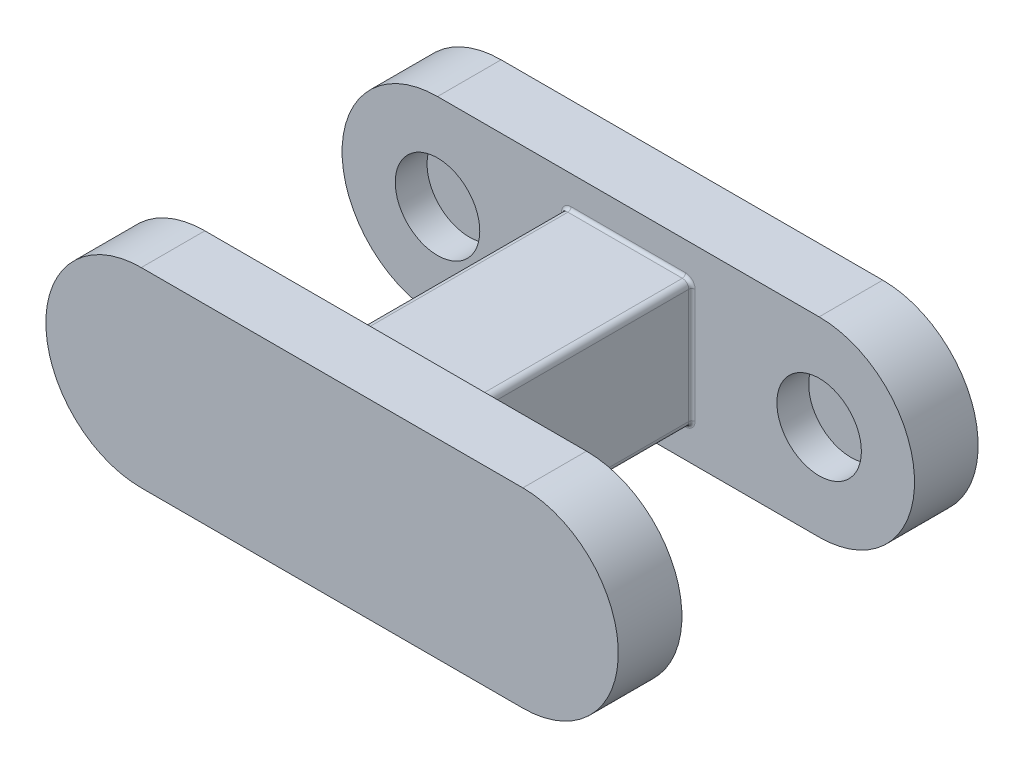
ISO-10303-21;
HEADER;
FILE_DESCRIPTION(('STEP AP214'),'2;1');
FILE_NAME('part.step','',(''),(''),'','','');
FILE_SCHEMA(('AUTOMOTIVE_DESIGN { 1 0 10303 214 1 1 1 1 }'));
ENDSEC;
DATA;
#1=APPLICATION_CONTEXT('core data for automotive mechanical design processes');
#2=APPLICATION_PROTOCOL_DEFINITION('international standard','automotive_design',2000,#1);
#3=PRODUCT_CONTEXT('',#1,'mechanical');
#4=PRODUCT('Part','Part','',(#3));
#5=PRODUCT_RELATED_PRODUCT_CATEGORY('part','',(#4));
#6=PRODUCT_DEFINITION_FORMATION('','',#4);
#7=PRODUCT_DEFINITION_CONTEXT('part definition',#1,'design');
#8=PRODUCT_DEFINITION('design','',#6,#7);
#9=PRODUCT_DEFINITION_SHAPE('','',#8);
#10=(LENGTH_UNIT() NAMED_UNIT(*) SI_UNIT(.MILLI.,.METRE.));
#11=(NAMED_UNIT(*) PLANE_ANGLE_UNIT() SI_UNIT($,.RADIAN.));
#12=(NAMED_UNIT(*) SI_UNIT($,.STERADIAN.) SOLID_ANGLE_UNIT());
#13=UNCERTAINTY_MEASURE_WITH_UNIT(LENGTH_MEASURE(1.E-05),#10,'distance_accuracy_value','');
#14=(GEOMETRIC_REPRESENTATION_CONTEXT(3) GLOBAL_UNCERTAINTY_ASSIGNED_CONTEXT((#13)) GLOBAL_UNIT_ASSIGNED_CONTEXT((#10,
#11,#12)) REPRESENTATION_CONTEXT('',''));
#15=CARTESIAN_POINT('',(0.,0.,0.));
#16=DIRECTION('',(0.,0.,1.));
#17=DIRECTION('',(1.,0.,0.));
#18=AXIS2_PLACEMENT_3D('',#15,#16,#17);
#19=CARTESIAN_POINT('',(-76.2,0.,25.4));
#20=DIRECTION('',(0.,0.,1.));
#21=DIRECTION('',(1.,0.,0.));
#22=AXIS2_PLACEMENT_3D('',#19,#20,#21);
#23=PLANE('',#22);
#24=DIRECTION('',(0.,-1.,0.));
#25=VECTOR('',#24,1.);
#26=CARTESIAN_POINT('',(-26.67,0.,25.4));
#27=LINE('',#26,#25);
#28=CARTESIAN_POINT('',(-26.67,-22.86,25.4));
#29=VERTEX_POINT('',#28);
#30=CARTESIAN_POINT('',(-26.67,22.86,25.4));
#31=VERTEX_POINT('',#30);
#32=EDGE_CURVE('E312',#29,#31,#27,.F.);
#33=ORIENTED_EDGE('',*,*,#32,.T.);
#34=CARTESIAN_POINT('',(-22.86,22.86,25.4));
#35=DIRECTION('',(0.,0.,1.));
#36=DIRECTION('',(1.,0.,0.));
#37=AXIS2_PLACEMENT_3D('',#34,#35,#36);
#38=CIRCLE('',#37,3.81);
#39=CARTESIAN_POINT('',(-22.86,26.67,25.4));
#40=VERTEX_POINT('',#39);
#41=EDGE_CURVE('E326',#31,#40,#38,.F.);
#42=ORIENTED_EDGE('',*,*,#41,.T.);
#43=DIRECTION('',(-1.,0.,0.));
#44=VECTOR('',#43,1.);
#45=CARTESIAN_POINT('',(-76.2,26.67,25.4));
#46=LINE('',#45,#44);
#47=CARTESIAN_POINT('',(22.86,26.67,25.4));
#48=VERTEX_POINT('',#47);
#49=EDGE_CURVE('E324',#40,#48,#46,.F.);
#50=ORIENTED_EDGE('',*,*,#49,.T.);
#51=CARTESIAN_POINT('',(22.86,22.86,25.4));
#52=DIRECTION('',(0.,0.,1.));
#53=DIRECTION('',(1.,0.,0.));
#54=AXIS2_PLACEMENT_3D('',#51,#52,#53);
#55=CIRCLE('',#54,3.81);
#56=CARTESIAN_POINT('',(26.67,22.86,25.4));
#57=VERTEX_POINT('',#56);
#58=EDGE_CURVE('E322',#48,#57,#55,.F.);
#59=ORIENTED_EDGE('',*,*,#58,.T.);
#60=DIRECTION('',(0.,1.,0.));
#61=VECTOR('',#60,1.);
#62=CARTESIAN_POINT('',(26.67,0.,25.4));
#63=LINE('',#62,#61);
#64=CARTESIAN_POINT('',(26.67,-22.86,25.4));
#65=VERTEX_POINT('',#64);
#66=EDGE_CURVE('E320',#57,#65,#63,.F.);
#67=ORIENTED_EDGE('',*,*,#66,.T.);
#68=CARTESIAN_POINT('',(22.86,-22.86,25.4));
#69=DIRECTION('',(0.,0.,1.));
#70=DIRECTION('',(1.,0.,0.));
#71=AXIS2_PLACEMENT_3D('',#68,#69,#70);
#72=CIRCLE('',#71,3.81);
#73=CARTESIAN_POINT('',(22.86,-26.67,25.4));
#74=VERTEX_POINT('',#73);
#75=EDGE_CURVE('E318',#65,#74,#72,.F.);
#76=ORIENTED_EDGE('',*,*,#75,.T.);
#77=DIRECTION('',(1.,0.,0.));
#78=VECTOR('',#77,1.);
#79=CARTESIAN_POINT('',(-76.2,-26.67,25.4));
#80=LINE('',#79,#78);
#81=CARTESIAN_POINT('',(-22.86,-26.67,25.4));
#82=VERTEX_POINT('',#81);
#83=EDGE_CURVE('E316',#74,#82,#80,.F.);
#84=ORIENTED_EDGE('',*,*,#83,.T.);
#85=CARTESIAN_POINT('',(-22.86,-22.86,25.4));
#86=DIRECTION('',(0.,0.,1.));
#87=DIRECTION('',(1.,0.,0.));
#88=AXIS2_PLACEMENT_3D('',#85,#86,#87);
#89=CIRCLE('',#88,3.81);
#90=EDGE_CURVE('E314',#82,#29,#89,.F.);
#91=ORIENTED_EDGE('',*,*,#90,.T.);
#92=EDGE_LOOP('',(#33,#42,#50,#59,#67,#76,#84,#91));
#93=FACE_BOUND('',#92,.T.);
#94=CARTESIAN_POINT('',(76.2,0.,25.4));
#95=DIRECTION('',(0.,0.,1.));
#96=DIRECTION('',(1.,0.,0.));
#97=AXIS2_PLACEMENT_3D('',#94,#95,#96);
#98=CIRCLE('',#97,16.87500000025);
#99=CARTESIAN_POINT('',(93.07500000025,0.,25.4));
#100=VERTEX_POINT('',#99);
#101=EDGE_CURVE('E257',#100,#100,#98,.T.);
#102=ORIENTED_EDGE('',*,*,#101,.F.);
#103=EDGE_LOOP('',(#102));
#104=FACE_BOUND('',#103,.T.);
#105=CARTESIAN_POINT('',(-76.2,0.,25.4));
#106=DIRECTION('',(0.,0.,1.));
#107=DIRECTION('',(1.,0.,0.));
#108=AXIS2_PLACEMENT_3D('',#105,#106,#107);
#109=CIRCLE('',#108,16.87500000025);
#110=CARTESIAN_POINT('',(-59.32499999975,0.,25.4));
#111=VERTEX_POINT('',#110);
#112=EDGE_CURVE('E260',#111,#111,#109,.T.);
#113=ORIENTED_EDGE('',*,*,#112,.F.);
#114=EDGE_LOOP('',(#113));
#115=FACE_BOUND('',#114,.T.);
#116=CARTESIAN_POINT('',(-76.2,0.,25.4));
#117=DIRECTION('',(0.,0.,1.));
#118=DIRECTION('',(1.,0.,0.));
#119=AXIS2_PLACEMENT_3D('',#116,#117,#118);
#120=CIRCLE('',#119,38.1);
#121=CARTESIAN_POINT('',(-76.2,38.1,25.4));
#122=VERTEX_POINT('',#121);
#123=CARTESIAN_POINT('',(-76.2,-38.1,25.4));
#124=VERTEX_POINT('',#123);
#125=EDGE_CURVE('E265',#122,#124,#120,.T.);
#126=ORIENTED_EDGE('',*,*,#125,.T.);
#127=DIRECTION('',(1.,0.,0.));
#128=VECTOR('',#127,1.);
#129=CARTESIAN_POINT('',(-76.2,-38.1,25.4));
#130=LINE('',#129,#128);
#131=CARTESIAN_POINT('',(76.2,-38.1,25.4));
#132=VERTEX_POINT('',#131);
#133=EDGE_CURVE('E268',#124,#132,#130,.T.);
#134=ORIENTED_EDGE('',*,*,#133,.T.);
#135=CARTESIAN_POINT('',(76.2,0.,25.4));
#136=DIRECTION('',(0.,0.,1.));
#137=DIRECTION('',(1.,0.,0.));
#138=AXIS2_PLACEMENT_3D('',#135,#136,#137);
#139=CIRCLE('',#138,38.1);
#140=CARTESIAN_POINT('',(76.2,38.1,25.4));
#141=VERTEX_POINT('',#140);
#142=EDGE_CURVE('E271',#132,#141,#139,.T.);
#143=ORIENTED_EDGE('',*,*,#142,.T.);
#144=DIRECTION('',(-1.,0.,0.));
#145=VECTOR('',#144,1.);
#146=CARTESIAN_POINT('',(-76.2,38.1,25.4));
#147=LINE('',#146,#145);
#148=EDGE_CURVE('E273',#141,#122,#147,.T.);
#149=ORIENTED_EDGE('',*,*,#148,.T.);
#150=EDGE_LOOP('',(#126,#134,#143,#149));
#151=FACE_BOUND('',#150,.T.);
#152=ADVANCED_FACE('F45',(#93,#104,#115,#151),#23,.T.);
#153=CARTESIAN_POINT('',(-76.2,0.,25.4));
#154=DIRECTION('',(0.,0.,-1.));
#155=DIRECTION('',(-1.,0.,0.));
#156=AXIS2_PLACEMENT_3D('',#153,#154,#155);
#157=CYLINDRICAL_SURFACE('',#156,38.1);
#158=CARTESIAN_POINT('',(-76.2,0.,0.));
#159=DIRECTION('',(0.,0.,1.));
#160=DIRECTION('',(1.,0.,0.));
#161=AXIS2_PLACEMENT_3D('',#158,#159,#160);
#162=CIRCLE('',#161,38.1);
#163=CARTESIAN_POINT('',(-76.2,38.1,0.));
#164=VERTEX_POINT('',#163);
#165=CARTESIAN_POINT('',(-76.2,-38.1,0.));
#166=VERTEX_POINT('',#165);
#167=EDGE_CURVE('E256',#164,#166,#162,.T.);
#168=ORIENTED_EDGE('',*,*,#167,.T.);
#169=DIRECTION('',(0.,0.,-1.));
#170=VECTOR('',#169,1.);
#171=CARTESIAN_POINT('',(-76.2,-38.1,25.4));
#172=LINE('',#171,#170);
#173=EDGE_CURVE('E291',#124,#166,#172,.T.);
#174=ORIENTED_EDGE('',*,*,#173,.F.);
#175=ORIENTED_EDGE('',*,*,#125,.F.);
#176=DIRECTION('',(0.,0.,-1.));
#177=VECTOR('',#176,1.);
#178=CARTESIAN_POINT('',(-76.2,38.1,25.4));
#179=LINE('',#178,#177);
#180=EDGE_CURVE('E275',#122,#164,#179,.T.);
#181=ORIENTED_EDGE('',*,*,#180,.T.);
#182=EDGE_LOOP('',(#168,#174,#175,#181));
#183=FACE_BOUND('',#182,.T.);
#184=ADVANCED_FACE('F513',(#183),#157,.T.);
#185=CARTESIAN_POINT('',(-76.2,-38.1,25.4));
#186=DIRECTION('',(0.,1.,0.));
#187=DIRECTION('',(-1.,0.,0.));
#188=AXIS2_PLACEMENT_3D('',#185,#186,#187);
#189=PLANE('',#188);
#190=DIRECTION('',(1.,0.,0.));
#191=VECTOR('',#190,1.);
#192=CARTESIAN_POINT('',(-76.2,-38.1,0.));
#193=LINE('',#192,#191);
#194=CARTESIAN_POINT('',(76.2,-38.1,0.));
#195=VERTEX_POINT('',#194);
#196=EDGE_CURVE('E278',#166,#195,#193,.T.);
#197=ORIENTED_EDGE('',*,*,#196,.T.);
#198=DIRECTION('',(0.,0.,-1.));
#199=VECTOR('',#198,1.);
#200=CARTESIAN_POINT('',(76.2,-38.1,25.4));
#201=LINE('',#200,#199);
#202=EDGE_CURVE('E288',#132,#195,#201,.T.);
#203=ORIENTED_EDGE('',*,*,#202,.F.);
#204=ORIENTED_EDGE('',*,*,#133,.F.);
#205=ORIENTED_EDGE('',*,*,#173,.T.);
#206=EDGE_LOOP('',(#197,#203,#204,#205));
#207=FACE_BOUND('',#206,.T.);
#208=ADVANCED_FACE('F520',(#207),#189,.F.);
#209=CARTESIAN_POINT('',(76.2,0.,25.4));
#210=DIRECTION('',(0.,0.,-1.));
#211=DIRECTION('',(-1.,0.,0.));
#212=AXIS2_PLACEMENT_3D('',#209,#210,#211);
#213=CYLINDRICAL_SURFACE('',#212,38.1);
#214=CARTESIAN_POINT('',(76.2,0.,0.));
#215=DIRECTION('',(0.,0.,1.));
#216=DIRECTION('',(1.,0.,0.));
#217=AXIS2_PLACEMENT_3D('',#214,#215,#216);
#218=CIRCLE('',#217,38.1);
#219=CARTESIAN_POINT('',(76.2,38.1,0.));
#220=VERTEX_POINT('',#219);
#221=EDGE_CURVE('E280',#195,#220,#218,.T.);
#222=ORIENTED_EDGE('',*,*,#221,.T.);
#223=DIRECTION('',(0.,0.,-1.));
#224=VECTOR('',#223,1.);
#225=CARTESIAN_POINT('',(76.2,38.1,25.4));
#226=LINE('',#225,#224);
#227=EDGE_CURVE('E285',#141,#220,#226,.T.);
#228=ORIENTED_EDGE('',*,*,#227,.F.);
#229=ORIENTED_EDGE('',*,*,#142,.F.);
#230=ORIENTED_EDGE('',*,*,#202,.T.);
#231=EDGE_LOOP('',(#222,#228,#229,#230));
#232=FACE_BOUND('',#231,.T.);
#233=ADVANCED_FACE('F535',(#232),#213,.T.);
#234=CARTESIAN_POINT('',(-76.2,38.1,25.4));
#235=DIRECTION('',(0.,-1.,0.));
#236=DIRECTION('',(1.,0.,0.));
#237=AXIS2_PLACEMENT_3D('',#234,#235,#236);
#238=PLANE('',#237);
#239=DIRECTION('',(-1.,0.,0.));
#240=VECTOR('',#239,1.);
#241=CARTESIAN_POINT('',(-76.2,38.1,0.));
#242=LINE('',#241,#240);
#243=EDGE_CURVE('E269',#220,#164,#242,.T.);
#244=ORIENTED_EDGE('',*,*,#243,.T.);
#245=ORIENTED_EDGE('',*,*,#180,.F.);
#246=ORIENTED_EDGE('',*,*,#148,.F.);
#247=ORIENTED_EDGE('',*,*,#227,.T.);
#248=EDGE_LOOP('',(#244,#245,#246,#247));
#249=FACE_BOUND('',#248,.T.);
#250=ADVANCED_FACE('F531',(#249),#238,.F.);
#251=CARTESIAN_POINT('',(-76.2,0.,0.));
#252=DIRECTION('',(0.,0.,1.));
#253=DIRECTION('',(1.,0.,0.));
#254=AXIS2_PLACEMENT_3D('',#251,#252,#253);
#255=PLANE('',#254);
#256=ORIENTED_EDGE('',*,*,#167,.F.);
#257=ORIENTED_EDGE('',*,*,#243,.F.);
#258=ORIENTED_EDGE('',*,*,#221,.F.);
#259=ORIENTED_EDGE('',*,*,#196,.F.);
#260=EDGE_LOOP('',(#256,#257,#258,#259));
#261=FACE_BOUND('',#260,.T.);
#262=ADVANCED_FACE('F527',(#261),#255,.F.);
#263=CARTESIAN_POINT('',(-76.2,0.,12.7));
#264=DIRECTION('',(0.,0.,1.));
#265=DIRECTION('',(1.,0.,0.));
#266=AXIS2_PLACEMENT_3D('',#263,#264,#265);
#267=CYLINDRICAL_SURFACE('',#266,16.87500000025);
#268=CARTESIAN_POINT('',(-76.2,0.,12.7));
#269=DIRECTION('',(0.,0.,1.));
#270=DIRECTION('',(1.,0.,0.));
#271=AXIS2_PLACEMENT_3D('',#268,#269,#270);
#272=CIRCLE('',#271,16.87500000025);
#273=CARTESIAN_POINT('',(-59.32499999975,0.,12.7));
#274=VERTEX_POINT('',#273);
#275=EDGE_CURVE('E219',#274,#274,#272,.T.);
#276=ORIENTED_EDGE('',*,*,#275,.F.);
#277=EDGE_LOOP('',(#276));
#278=FACE_BOUND('',#277,.T.);
#279=ORIENTED_EDGE('',*,*,#112,.T.);
#280=EDGE_LOOP('',(#279));
#281=FACE_BOUND('',#280,.T.);
#282=ADVANCED_FACE('F530',(#278,#281),#267,.F.);
#283=CARTESIAN_POINT('',(-76.2,0.,12.7));
#284=DIRECTION('',(0.,0.,1.));
#285=DIRECTION('',(1.,0.,0.));
#286=AXIS2_PLACEMENT_3D('',#283,#284,#285);
#287=PLANE('',#286);
#288=ORIENTED_EDGE('',*,*,#275,.T.);
#289=EDGE_LOOP('',(#288));
#290=FACE_BOUND('',#289,.T.);
#291=ADVANCED_FACE('F525',(#290),#287,.T.);
#292=CARTESIAN_POINT('',(76.2,0.,12.7));
#293=DIRECTION('',(0.,0.,1.));
#294=DIRECTION('',(1.,0.,0.));
#295=AXIS2_PLACEMENT_3D('',#292,#293,#294);
#296=CYLINDRICAL_SURFACE('',#295,16.87500000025);
#297=CARTESIAN_POINT('',(76.2,0.,12.7));
#298=DIRECTION('',(0.,0.,1.));
#299=DIRECTION('',(1.,0.,0.));
#300=AXIS2_PLACEMENT_3D('',#297,#298,#299);
#301=CIRCLE('',#300,16.87500000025);
#302=CARTESIAN_POINT('',(93.07500000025,0.,12.7));
#303=VERTEX_POINT('',#302);
#304=EDGE_CURVE('E253',#303,#303,#301,.T.);
#305=ORIENTED_EDGE('',*,*,#304,.F.);
#306=EDGE_LOOP('',(#305));
#307=FACE_BOUND('',#306,.T.);
#308=ORIENTED_EDGE('',*,*,#101,.T.);
#309=EDGE_LOOP('',(#308));
#310=FACE_BOUND('',#309,.T.);
#311=ADVANCED_FACE('F845',(#307,#310),#296,.F.);
#312=CARTESIAN_POINT('',(76.2,0.,12.7));
#313=DIRECTION('',(0.,0.,1.));
#314=DIRECTION('',(1.,0.,0.));
#315=AXIS2_PLACEMENT_3D('',#312,#313,#314);
#316=PLANE('',#315);
#317=ORIENTED_EDGE('',*,*,#304,.T.);
#318=EDGE_LOOP('',(#317));
#319=FACE_BOUND('',#318,.T.);
#320=ADVANCED_FACE('F621',(#319),#316,.T.);
#321=CARTESIAN_POINT('',(25.4,25.4,118.3));
#322=DIRECTION('',(-1.,0.,0.));
#323=DIRECTION('',(0.,0.,1.));
#324=AXIS2_PLACEMENT_3D('',#321,#322,#323);
#325=PLANE('',#324);
#326=DIRECTION('',(0.,0.,-1.));
#327=VECTOR('',#326,1.);
#328=CARTESIAN_POINT('',(25.4,22.86,118.3));
#329=LINE('',#328,#327);
#330=CARTESIAN_POINT('',(25.4,22.86,26.67));
#331=VERTEX_POINT('',#330);
#332=CARTESIAN_POINT('',(25.4,22.86,117.03));
#333=VERTEX_POINT('',#332);
#334=EDGE_CURVE('E301',#331,#333,#329,.F.);
#335=ORIENTED_EDGE('',*,*,#334,.T.);
#336=DIRECTION('',(0.,1.,0.));
#337=VECTOR('',#336,1.);
#338=CARTESIAN_POINT('',(25.4,25.4,117.03));
#339=LINE('',#338,#337);
#340=CARTESIAN_POINT('',(25.4,-22.86,117.03));
#341=VERTEX_POINT('',#340);
#342=EDGE_CURVE('E397',#333,#341,#339,.F.);
#343=ORIENTED_EDGE('',*,*,#342,.T.);
#344=DIRECTION('',(0.,0.,-1.));
#345=VECTOR('',#344,1.);
#346=CARTESIAN_POINT('',(25.4,-22.86,118.3));
#347=LINE('',#346,#345);
#348=CARTESIAN_POINT('',(25.4,-22.86,26.67));
#349=VERTEX_POINT('',#348);
#350=EDGE_CURVE('E299',#341,#349,#347,.T.);
#351=ORIENTED_EDGE('',*,*,#350,.T.);
#352=DIRECTION('',(0.,1.,0.));
#353=VECTOR('',#352,1.);
#354=CARTESIAN_POINT('',(25.4,25.4,26.67));
#355=LINE('',#354,#353);
#356=EDGE_CURVE('E337',#349,#331,#355,.T.);
#357=ORIENTED_EDGE('',*,*,#356,.T.);
#358=EDGE_LOOP('',(#335,#343,#351,#357));
#359=FACE_BOUND('',#358,.T.);
#360=ADVANCED_FACE('F466',(#359),#325,.F.);
#361=CARTESIAN_POINT('',(-25.4,25.4,118.3));
#362=DIRECTION('',(0.,-1.,0.));
#363=DIRECTION('',(0.,0.,-1.));
#364=AXIS2_PLACEMENT_3D('',#361,#362,#363);
#365=PLANE('',#364);
#366=DIRECTION('',(0.,0.,-1.));
#367=VECTOR('',#366,1.);
#368=CARTESIAN_POINT('',(-22.86,25.4,118.3));
#369=LINE('',#368,#367);
#370=CARTESIAN_POINT('',(-22.86,25.4,26.67));
#371=VERTEX_POINT('',#370);
#372=CARTESIAN_POINT('',(-22.86,25.4,117.03));
#373=VERTEX_POINT('',#372);
#374=EDGE_CURVE('E294',#371,#373,#369,.F.);
#375=ORIENTED_EDGE('',*,*,#374,.T.);
#376=DIRECTION('',(-1.,0.,0.));
#377=VECTOR('',#376,1.);
#378=CARTESIAN_POINT('',(-25.4,25.4,117.03));
#379=LINE('',#378,#377);
#380=CARTESIAN_POINT('',(22.86,25.4,117.03));
#381=VERTEX_POINT('',#380);
#382=EDGE_CURVE('E393',#373,#381,#379,.F.);
#383=ORIENTED_EDGE('',*,*,#382,.T.);
#384=DIRECTION('',(0.,0.,-1.));
#385=VECTOR('',#384,1.);
#386=CARTESIAN_POINT('',(22.86,25.4,118.3));
#387=LINE('',#386,#385);
#388=CARTESIAN_POINT('',(22.86,25.4,26.67));
#389=VERTEX_POINT('',#388);
#390=EDGE_CURVE('E297',#381,#389,#387,.T.);
#391=ORIENTED_EDGE('',*,*,#390,.T.);
#392=DIRECTION('',(-1.,0.,0.));
#393=VECTOR('',#392,1.);
#394=CARTESIAN_POINT('',(-25.4,25.4,26.67));
#395=LINE('',#394,#393);
#396=EDGE_CURVE('E332',#389,#371,#395,.T.);
#397=ORIENTED_EDGE('',*,*,#396,.T.);
#398=EDGE_LOOP('',(#375,#383,#391,#397));
#399=FACE_BOUND('',#398,.T.);
#400=ADVANCED_FACE('F620',(#399),#365,.F.);
#401=CARTESIAN_POINT('',(-25.4,25.4,118.3));
#402=DIRECTION('',(1.,0.,0.));
#403=DIRECTION('',(0.,0.,-1.));
#404=AXIS2_PLACEMENT_3D('',#401,#402,#403);
#405=PLANE('',#404);
#406=DIRECTION('',(0.,0.,-1.));
#407=VECTOR('',#406,1.);
#408=CARTESIAN_POINT('',(-25.4,-22.86,118.3));
#409=LINE('',#408,#407);
#410=CARTESIAN_POINT('',(-25.4,-22.86,26.67));
#411=VERTEX_POINT('',#410);
#412=CARTESIAN_POINT('',(-25.4,-22.86,117.03));
#413=VERTEX_POINT('',#412);
#414=EDGE_CURVE('E310',#411,#413,#409,.F.);
#415=ORIENTED_EDGE('',*,*,#414,.T.);
#416=DIRECTION('',(0.,-1.,0.));
#417=VECTOR('',#416,1.);
#418=CARTESIAN_POINT('',(-25.4,25.4,117.03));
#419=LINE('',#418,#417);
#420=CARTESIAN_POINT('',(-25.4,22.86,117.03));
#421=VERTEX_POINT('',#420);
#422=EDGE_CURVE('E11',#413,#421,#419,.F.);
#423=ORIENTED_EDGE('',*,*,#422,.T.);
#424=DIRECTION('',(0.,0.,-1.));
#425=VECTOR('',#424,1.);
#426=CARTESIAN_POINT('',(-25.4,22.86,118.3));
#427=LINE('',#426,#425);
#428=CARTESIAN_POINT('',(-25.4,22.86,26.67));
#429=VERTEX_POINT('',#428);
#430=EDGE_CURVE('E308',#421,#429,#427,.T.);
#431=ORIENTED_EDGE('',*,*,#430,.T.);
#432=DIRECTION('',(0.,-1.,0.));
#433=VECTOR('',#432,1.);
#434=CARTESIAN_POINT('',(-25.4,25.4,26.67));
#435=LINE('',#434,#433);
#436=EDGE_CURVE('E347',#429,#411,#435,.T.);
#437=ORIENTED_EDGE('',*,*,#436,.T.);
#438=EDGE_LOOP('',(#415,#423,#431,#437));
#439=FACE_BOUND('',#438,.T.);
#440=ADVANCED_FACE('F497',(#439),#405,.F.);
#441=CARTESIAN_POINT('',(-25.4,-25.4,118.3));
#442=DIRECTION('',(0.,1.,0.));
#443=DIRECTION('',(0.,0.,1.));
#444=AXIS2_PLACEMENT_3D('',#441,#442,#443);
#445=PLANE('',#444);
#446=DIRECTION('',(0.,0.,-1.));
#447=VECTOR('',#446,1.);
#448=CARTESIAN_POINT('',(22.86,-25.4,118.3));
#449=LINE('',#448,#447);
#450=CARTESIAN_POINT('',(22.86,-25.4,26.67));
#451=VERTEX_POINT('',#450);
#452=CARTESIAN_POINT('',(22.86,-25.4,117.03));
#453=VERTEX_POINT('',#452);
#454=EDGE_CURVE('E306',#451,#453,#449,.F.);
#455=ORIENTED_EDGE('',*,*,#454,.T.);
#456=DIRECTION('',(1.,0.,0.));
#457=VECTOR('',#456,1.);
#458=CARTESIAN_POINT('',(-25.4,-25.4,117.03));
#459=LINE('',#458,#457);
#460=CARTESIAN_POINT('',(-22.86,-25.4,117.03));
#461=VERTEX_POINT('',#460);
#462=EDGE_CURVE('E69',#453,#461,#459,.F.);
#463=ORIENTED_EDGE('',*,*,#462,.T.);
#464=DIRECTION('',(0.,0.,-1.));
#465=VECTOR('',#464,1.);
#466=CARTESIAN_POINT('',(-22.86,-25.4,118.3));
#467=LINE('',#466,#465);
#468=CARTESIAN_POINT('',(-22.86,-25.4,26.67));
#469=VERTEX_POINT('',#468);
#470=EDGE_CURVE('E304',#461,#469,#467,.T.);
#471=ORIENTED_EDGE('',*,*,#470,.T.);
#472=DIRECTION('',(1.,0.,0.));
#473=VECTOR('',#472,1.);
#474=CARTESIAN_POINT('',(-25.4,-25.4,26.67));
#475=LINE('',#474,#473);
#476=EDGE_CURVE('E342',#469,#451,#475,.T.);
#477=ORIENTED_EDGE('',*,*,#476,.T.);
#478=EDGE_LOOP('',(#455,#463,#471,#477));
#479=FACE_BOUND('',#478,.T.);
#480=ADVANCED_FACE('F438',(#479),#445,.F.);
#481=CARTESIAN_POINT('',(-76.2,0.,118.3));
#482=DIRECTION('',(0.,0.,1.));
#483=DIRECTION('',(1.,0.,0.));
#484=AXIS2_PLACEMENT_3D('',#481,#482,#483);
#485=CYLINDRICAL_SURFACE('',#484,38.1);
#486=CARTESIAN_POINT('',(-76.2,0.,143.7));
#487=DIRECTION('',(0.,0.,1.));
#488=DIRECTION('',(1.,0.,0.));
#489=AXIS2_PLACEMENT_3D('',#486,#487,#488);
#490=CIRCLE('',#489,38.1);
#491=CARTESIAN_POINT('',(-76.2,38.1,143.7));
#492=VERTEX_POINT('',#491);
#493=CARTESIAN_POINT('',(-76.2,-38.1,143.7));
#494=VERTEX_POINT('',#493);
#495=EDGE_CURVE('E214',#492,#494,#490,.T.);
#496=ORIENTED_EDGE('',*,*,#495,.F.);
#497=DIRECTION('',(0.,0.,1.));
#498=VECTOR('',#497,1.);
#499=CARTESIAN_POINT('',(-76.2,38.1,118.3));
#500=LINE('',#499,#498);
#501=CARTESIAN_POINT('',(-76.2,38.1,118.3));
#502=VERTEX_POINT('',#501);
#503=EDGE_CURVE('E208',#502,#492,#500,.T.);
#504=ORIENTED_EDGE('',*,*,#503,.F.);
#505=CARTESIAN_POINT('',(-76.2,0.,118.3));
#506=DIRECTION('',(0.,0.,1.));
#507=DIRECTION('',(1.,0.,0.));
#508=AXIS2_PLACEMENT_3D('',#505,#506,#507);
#509=CIRCLE('',#508,38.1);
#510=CARTESIAN_POINT('',(-76.2,-38.1,118.3));
#511=VERTEX_POINT('',#510);
#512=EDGE_CURVE('E211',#502,#511,#509,.T.);
#513=ORIENTED_EDGE('',*,*,#512,.T.);
#514=DIRECTION('',(0.,0.,1.));
#515=VECTOR('',#514,1.);
#516=CARTESIAN_POINT('',(-76.2,-38.1,118.3));
#517=LINE('',#516,#515);
#518=EDGE_CURVE('E239',#511,#494,#517,.T.);
#519=ORIENTED_EDGE('',*,*,#518,.T.);
#520=EDGE_LOOP('',(#496,#504,#513,#519));
#521=FACE_BOUND('',#520,.T.);
#522=ADVANCED_FACE('F210',(#521),#485,.T.);
#523=CARTESIAN_POINT('',(-76.2,38.1,118.3));
#524=DIRECTION('',(0.,1.,0.));
#525=DIRECTION('',(-1.,0.,0.));
#526=AXIS2_PLACEMENT_3D('',#523,#524,#525);
#527=PLANE('',#526);
#528=DIRECTION('',(-1.,0.,0.));
#529=VECTOR('',#528,1.);
#530=CARTESIAN_POINT('',(-76.2,38.1,143.7));
#531=LINE('',#530,#529);
#532=CARTESIAN_POINT('',(76.2,38.1,143.7));
#533=VERTEX_POINT('',#532);
#534=EDGE_CURVE('E241',#533,#492,#531,.T.);
#535=ORIENTED_EDGE('',*,*,#534,.F.);
#536=DIRECTION('',(0.,0.,1.));
#537=VECTOR('',#536,1.);
#538=CARTESIAN_POINT('',(76.2,38.1,118.3));
#539=LINE('',#538,#537);
#540=CARTESIAN_POINT('',(76.2,38.1,118.3));
#541=VERTEX_POINT('',#540);
#542=EDGE_CURVE('E220',#541,#533,#539,.T.);
#543=ORIENTED_EDGE('',*,*,#542,.F.);
#544=DIRECTION('',(-1.,0.,0.));
#545=VECTOR('',#544,1.);
#546=CARTESIAN_POINT('',(-76.2,38.1,118.3));
#547=LINE('',#546,#545);
#548=EDGE_CURVE('E226',#541,#502,#547,.T.);
#549=ORIENTED_EDGE('',*,*,#548,.T.);
#550=ORIENTED_EDGE('',*,*,#503,.T.);
#551=EDGE_LOOP('',(#535,#543,#549,#550));
#552=FACE_BOUND('',#551,.T.);
#553=ADVANCED_FACE('F232',(#552),#527,.T.);
#554=CARTESIAN_POINT('',(76.2,0.,118.3));
#555=DIRECTION('',(0.,0.,1.));
#556=DIRECTION('',(1.,0.,0.));
#557=AXIS2_PLACEMENT_3D('',#554,#555,#556);
#558=CYLINDRICAL_SURFACE('',#557,38.1);
#559=CARTESIAN_POINT('',(76.2,0.,143.7));
#560=DIRECTION('',(0.,0.,1.));
#561=DIRECTION('',(1.,0.,0.));
#562=AXIS2_PLACEMENT_3D('',#559,#560,#561);
#563=CIRCLE('',#562,38.1);
#564=CARTESIAN_POINT('',(76.2,-38.1,143.7));
#565=VERTEX_POINT('',#564);
#566=EDGE_CURVE('E244',#565,#533,#563,.T.);
#567=ORIENTED_EDGE('',*,*,#566,.F.);
#568=DIRECTION('',(0.,0.,1.));
#569=VECTOR('',#568,1.);
#570=CARTESIAN_POINT('',(76.2,-38.1,118.3));
#571=LINE('',#570,#569);
#572=CARTESIAN_POINT('',(76.2,-38.1,118.3));
#573=VERTEX_POINT('',#572);
#574=EDGE_CURVE('E250',#573,#565,#571,.T.);
#575=ORIENTED_EDGE('',*,*,#574,.F.);
#576=CARTESIAN_POINT('',(76.2,0.,118.3));
#577=DIRECTION('',(0.,0.,1.));
#578=DIRECTION('',(1.,0.,0.));
#579=AXIS2_PLACEMENT_3D('',#576,#577,#578);
#580=CIRCLE('',#579,38.1);
#581=EDGE_CURVE('E233',#573,#541,#580,.T.);
#582=ORIENTED_EDGE('',*,*,#581,.T.);
#583=ORIENTED_EDGE('',*,*,#542,.T.);
#584=EDGE_LOOP('',(#567,#575,#582,#583));
#585=FACE_BOUND('',#584,.T.);
#586=ADVANCED_FACE('F808',(#585),#558,.T.);
#587=CARTESIAN_POINT('',(-76.2,-38.1,118.3));
#588=DIRECTION('',(0.,-1.,0.));
#589=DIRECTION('',(1.,0.,0.));
#590=AXIS2_PLACEMENT_3D('',#587,#588,#589);
#591=PLANE('',#590);
#592=DIRECTION('',(1.,0.,0.));
#593=VECTOR('',#592,1.);
#594=CARTESIAN_POINT('',(-76.2,-38.1,143.7));
#595=LINE('',#594,#593);
#596=EDGE_CURVE('E230',#494,#565,#595,.T.);
#597=ORIENTED_EDGE('',*,*,#596,.F.);
#598=ORIENTED_EDGE('',*,*,#518,.F.);
#599=DIRECTION('',(1.,0.,0.));
#600=VECTOR('',#599,1.);
#601=CARTESIAN_POINT('',(-76.2,-38.1,118.3));
#602=LINE('',#601,#600);
#603=EDGE_CURVE('E229',#511,#573,#602,.T.);
#604=ORIENTED_EDGE('',*,*,#603,.T.);
#605=ORIENTED_EDGE('',*,*,#574,.T.);
#606=EDGE_LOOP('',(#597,#598,#604,#605));
#607=FACE_BOUND('',#606,.T.);
#608=ADVANCED_FACE('F653',(#607),#591,.T.);
#609=CARTESIAN_POINT('',(-76.2,0.,118.3));
#610=DIRECTION('',(0.,0.,-1.));
#611=DIRECTION('',(1.,0.,0.));
#612=AXIS2_PLACEMENT_3D('',#609,#610,#611);
#613=PLANE('',#612);
#614=DIRECTION('',(-1.,0.,0.));
#615=VECTOR('',#614,1.);
#616=CARTESIAN_POINT('',(-76.2,26.67,118.3));
#617=LINE('',#616,#615);
#618=CARTESIAN_POINT('',(22.86,26.67,118.3));
#619=VERTEX_POINT('',#618);
#620=CARTESIAN_POINT('',(-22.86,26.67,118.3));
#621=VERTEX_POINT('',#620);
#622=EDGE_CURVE('E385',#619,#621,#617,.T.);
#623=ORIENTED_EDGE('',*,*,#622,.T.);
#624=CARTESIAN_POINT('',(-22.86,22.86,118.3));
#625=DIRECTION('',(0.,0.,-1.));
#626=DIRECTION('',(-1.,0.,0.));
#627=AXIS2_PLACEMENT_3D('',#624,#625,#626);
#628=CIRCLE('',#627,3.81);
#629=CARTESIAN_POINT('',(-26.67,22.86,118.3));
#630=VERTEX_POINT('',#629);
#631=EDGE_CURVE('E387',#621,#630,#628,.F.);
#632=ORIENTED_EDGE('',*,*,#631,.T.);
#633=DIRECTION('',(0.,-1.,0.));
#634=VECTOR('',#633,1.);
#635=CARTESIAN_POINT('',(-26.67,0.,118.3));
#636=LINE('',#635,#634);
#637=CARTESIAN_POINT('',(-26.67,-22.86,118.3));
#638=VERTEX_POINT('',#637);
#639=EDGE_CURVE('E349',#630,#638,#636,.T.);
#640=ORIENTED_EDGE('',*,*,#639,.T.);
#641=CARTESIAN_POINT('',(-22.86,-22.86,118.3));
#642=DIRECTION('',(0.,0.,-1.));
#643=DIRECTION('',(-1.,0.,0.));
#644=AXIS2_PLACEMENT_3D('',#641,#642,#643);
#645=CIRCLE('',#644,3.81);
#646=CARTESIAN_POINT('',(-22.86,-26.67,118.3));
#647=VERTEX_POINT('',#646);
#648=EDGE_CURVE('E375',#638,#647,#645,.F.);
#649=ORIENTED_EDGE('',*,*,#648,.T.);
#650=DIRECTION('',(1.,0.,0.));
#651=VECTOR('',#650,1.);
#652=CARTESIAN_POINT('',(-76.2,-26.67,118.3));
#653=LINE('',#652,#651);
#654=CARTESIAN_POINT('',(22.86,-26.67,118.3));
#655=VERTEX_POINT('',#654);
#656=EDGE_CURVE('E377',#647,#655,#653,.T.);
#657=ORIENTED_EDGE('',*,*,#656,.T.);
#658=CARTESIAN_POINT('',(22.86,-22.86,118.3));
#659=DIRECTION('',(0.,0.,-1.));
#660=DIRECTION('',(-1.,0.,0.));
#661=AXIS2_PLACEMENT_3D('',#658,#659,#660);
#662=CIRCLE('',#661,3.81);
#663=CARTESIAN_POINT('',(26.67,-22.86,118.3));
#664=VERTEX_POINT('',#663);
#665=EDGE_CURVE('E379',#655,#664,#662,.F.);
#666=ORIENTED_EDGE('',*,*,#665,.T.);
#667=DIRECTION('',(0.,1.,0.));
#668=VECTOR('',#667,1.);
#669=CARTESIAN_POINT('',(26.67,0.,118.3));
#670=LINE('',#669,#668);
#671=CARTESIAN_POINT('',(26.67,22.86,118.3));
#672=VERTEX_POINT('',#671);
#673=EDGE_CURVE('E381',#664,#672,#670,.T.);
#674=ORIENTED_EDGE('',*,*,#673,.T.);
#675=CARTESIAN_POINT('',(22.86,22.86,118.3));
#676=DIRECTION('',(0.,0.,-1.));
#677=DIRECTION('',(-1.,0.,0.));
#678=AXIS2_PLACEMENT_3D('',#675,#676,#677);
#679=CIRCLE('',#678,3.81);
#680=EDGE_CURVE('E383',#672,#619,#679,.F.);
#681=ORIENTED_EDGE('',*,*,#680,.T.);
#682=EDGE_LOOP('',(#623,#632,#640,#649,#657,#666,#674,#681));
#683=FACE_BOUND('',#682,.T.);
#684=CARTESIAN_POINT('',(76.2,0.,118.3));
#685=DIRECTION('',(0.,0.,1.));
#686=DIRECTION('',(1.,0.,0.));
#687=AXIS2_PLACEMENT_3D('',#684,#685,#686);
#688=CIRCLE('',#687,16.87500000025);
#689=CARTESIAN_POINT('',(93.07500000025,0.,118.3));
#690=VERTEX_POINT('',#689);
#691=EDGE_CURVE('E941',#690,#690,#688,.T.);
#692=ORIENTED_EDGE('',*,*,#691,.T.);
#693=EDGE_LOOP('',(#692));
#694=FACE_BOUND('',#693,.T.);
#695=CARTESIAN_POINT('',(-76.2,0.,118.3));
#696=DIRECTION('',(0.,0.,1.));
#697=DIRECTION('',(1.,0.,0.));
#698=AXIS2_PLACEMENT_3D('',#695,#696,#697);
#699=CIRCLE('',#698,16.87500000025);
#700=CARTESIAN_POINT('',(-59.32499999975,0.,118.3));
#701=VERTEX_POINT('',#700);
#702=EDGE_CURVE('E373',#701,#701,#699,.T.);
#703=ORIENTED_EDGE('',*,*,#702,.T.);
#704=EDGE_LOOP('',(#703));
#705=FACE_BOUND('',#704,.T.);
#706=ORIENTED_EDGE('',*,*,#512,.F.);
#707=ORIENTED_EDGE('',*,*,#548,.F.);
#708=ORIENTED_EDGE('',*,*,#581,.F.);
#709=ORIENTED_EDGE('',*,*,#603,.F.);
#710=EDGE_LOOP('',(#706,#707,#708,#709));
#711=FACE_BOUND('',#710,.T.);
#712=ADVANCED_FACE('F224',(#683,#694,#705,#711),#613,.T.);
#713=CARTESIAN_POINT('',(-76.2,0.,143.7));
#714=DIRECTION('',(0.,0.,-1.));
#715=DIRECTION('',(1.,0.,0.));
#716=AXIS2_PLACEMENT_3D('',#713,#714,#715);
#717=PLANE('',#716);
#718=ORIENTED_EDGE('',*,*,#495,.T.);
#719=ORIENTED_EDGE('',*,*,#596,.T.);
#720=ORIENTED_EDGE('',*,*,#566,.T.);
#721=ORIENTED_EDGE('',*,*,#534,.T.);
#722=EDGE_LOOP('',(#718,#719,#720,#721));
#723=FACE_BOUND('',#722,.T.);
#724=ADVANCED_FACE('F652',(#723),#717,.F.);
#725=CARTESIAN_POINT('',(-76.2,0.,131.));
#726=DIRECTION('',(0.,0.,-1.));
#727=DIRECTION('',(-1.,0.,0.));
#728=AXIS2_PLACEMENT_3D('',#725,#726,#727);
#729=CYLINDRICAL_SURFACE('',#728,16.87500000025);
#730=CARTESIAN_POINT('',(-76.2,0.,131.));
#731=DIRECTION('',(0.,0.,1.));
#732=DIRECTION('',(1.,0.,0.));
#733=AXIS2_PLACEMENT_3D('',#730,#731,#732);
#734=CIRCLE('',#733,16.87500000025);
#735=CARTESIAN_POINT('',(-59.32499999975,0.,131.));
#736=VERTEX_POINT('',#735);
#737=EDGE_CURVE('E937',#736,#736,#734,.T.);
#738=ORIENTED_EDGE('',*,*,#737,.T.);
#739=EDGE_LOOP('',(#738));
#740=FACE_BOUND('',#739,.T.);
#741=ORIENTED_EDGE('',*,*,#702,.F.);
#742=EDGE_LOOP('',(#741));
#743=FACE_BOUND('',#742,.T.);
#744=ADVANCED_FACE('F784',(#740,#743),#729,.F.);
#745=CARTESIAN_POINT('',(-76.2,0.,131.));
#746=DIRECTION('',(0.,0.,-1.));
#747=DIRECTION('',(1.,0.,0.));
#748=AXIS2_PLACEMENT_3D('',#745,#746,#747);
#749=PLANE('',#748);
#750=ORIENTED_EDGE('',*,*,#737,.F.);
#751=EDGE_LOOP('',(#750));
#752=FACE_BOUND('',#751,.T.);
#753=ADVANCED_FACE('F775',(#752),#749,.T.);
#754=CARTESIAN_POINT('',(76.2,0.,131.));
#755=DIRECTION('',(0.,0.,-1.));
#756=DIRECTION('',(-1.,0.,0.));
#757=AXIS2_PLACEMENT_3D('',#754,#755,#756);
#758=CYLINDRICAL_SURFACE('',#757,16.87500000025);
#759=CARTESIAN_POINT('',(76.2,0.,131.));
#760=DIRECTION('',(0.,0.,1.));
#761=DIRECTION('',(1.,0.,0.));
#762=AXIS2_PLACEMENT_3D('',#759,#760,#761);
#763=CIRCLE('',#762,16.87500000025);
#764=CARTESIAN_POINT('',(93.07500000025,0.,131.));
#765=VERTEX_POINT('',#764);
#766=EDGE_CURVE('E242',#765,#765,#763,.T.);
#767=ORIENTED_EDGE('',*,*,#766,.T.);
#768=EDGE_LOOP('',(#767));
#769=FACE_BOUND('',#768,.T.);
#770=ORIENTED_EDGE('',*,*,#691,.F.);
#771=EDGE_LOOP('',(#770));
#772=FACE_BOUND('',#771,.T.);
#773=ADVANCED_FACE('F766',(#769,#772),#758,.F.);
#774=CARTESIAN_POINT('',(76.2,0.,131.));
#775=DIRECTION('',(0.,0.,-1.));
#776=DIRECTION('',(1.,0.,0.));
#777=AXIS2_PLACEMENT_3D('',#774,#775,#776);
#778=PLANE('',#777);
#779=ORIENTED_EDGE('',*,*,#766,.F.);
#780=EDGE_LOOP('',(#779));
#781=FACE_BOUND('',#780,.T.);
#782=ADVANCED_FACE('F545',(#781),#778,.T.);
#783=CARTESIAN_POINT('',(22.86,22.86,118.3));
#784=DIRECTION('',(0.,0.,-1.));
#785=DIRECTION('',(-1.,0.,0.));
#786=AXIS2_PLACEMENT_3D('',#783,#784,#785);
#787=CYLINDRICAL_SURFACE('',#786,2.54);
#788=ORIENTED_EDGE('',*,*,#390,.F.);
#789=CARTESIAN_POINT('',(22.86,22.86,117.03));
#790=DIRECTION('',(0.,0.,-1.));
#791=DIRECTION('',(-1.,0.,0.));
#792=AXIS2_PLACEMENT_3D('',#789,#790,#791);
#793=CIRCLE('',#792,2.54);
#794=EDGE_CURVE('E395',#381,#333,#793,.T.);
#795=ORIENTED_EDGE('',*,*,#794,.T.);
#796=ORIENTED_EDGE('',*,*,#334,.F.);
#797=CARTESIAN_POINT('',(22.86,22.86,26.67));
#798=DIRECTION('',(0.,0.,1.));
#799=DIRECTION('',(1.,0.,0.));
#800=AXIS2_PLACEMENT_3D('',#797,#798,#799);
#801=CIRCLE('',#800,2.54);
#802=EDGE_CURVE('E334',#331,#389,#801,.T.);
#803=ORIENTED_EDGE('',*,*,#802,.T.);
#804=EDGE_LOOP('',(#788,#795,#796,#803));
#805=FACE_BOUND('',#804,.T.);
#806=ADVANCED_FACE('F469',(#805),#787,.T.);
#807=CARTESIAN_POINT('',(22.86,-22.86,118.3));
#808=DIRECTION('',(0.,0.,-1.));
#809=DIRECTION('',(-1.,0.,0.));
#810=AXIS2_PLACEMENT_3D('',#807,#808,#809);
#811=CYLINDRICAL_SURFACE('',#810,2.54);
#812=ORIENTED_EDGE('',*,*,#350,.F.);
#813=CARTESIAN_POINT('',(22.86,-22.86,117.03));
#814=DIRECTION('',(0.,0.,-1.));
#815=DIRECTION('',(-1.,0.,0.));
#816=AXIS2_PLACEMENT_3D('',#813,#814,#815);
#817=CIRCLE('',#816,2.54);
#818=EDGE_CURVE('E399',#341,#453,#817,.T.);
#819=ORIENTED_EDGE('',*,*,#818,.T.);
#820=ORIENTED_EDGE('',*,*,#454,.F.);
#821=CARTESIAN_POINT('',(22.86,-22.86,26.67));
#822=DIRECTION('',(0.,0.,1.));
#823=DIRECTION('',(1.,0.,0.));
#824=AXIS2_PLACEMENT_3D('',#821,#822,#823);
#825=CIRCLE('',#824,2.54);
#826=EDGE_CURVE('E339',#451,#349,#825,.T.);
#827=ORIENTED_EDGE('',*,*,#826,.T.);
#828=EDGE_LOOP('',(#812,#819,#820,#827));
#829=FACE_BOUND('',#828,.T.);
#830=ADVANCED_FACE('F436',(#829),#811,.T.);
#831=CARTESIAN_POINT('',(-22.86,-22.86,118.3));
#832=DIRECTION('',(0.,0.,-1.));
#833=DIRECTION('',(-1.,0.,0.));
#834=AXIS2_PLACEMENT_3D('',#831,#832,#833);
#835=CYLINDRICAL_SURFACE('',#834,2.54);
#836=ORIENTED_EDGE('',*,*,#470,.F.);
#837=CARTESIAN_POINT('',(-22.86,-22.86,117.03));
#838=DIRECTION('',(0.,0.,-1.));
#839=DIRECTION('',(-1.,0.,0.));
#840=AXIS2_PLACEMENT_3D('',#837,#838,#839);
#841=CIRCLE('',#840,2.54);
#842=EDGE_CURVE('E54',#461,#413,#841,.T.);
#843=ORIENTED_EDGE('',*,*,#842,.T.);
#844=ORIENTED_EDGE('',*,*,#414,.F.);
#845=CARTESIAN_POINT('',(-22.86,-22.86,26.67));
#846=DIRECTION('',(0.,0.,1.));
#847=DIRECTION('',(1.,0.,0.));
#848=AXIS2_PLACEMENT_3D('',#845,#846,#847);
#849=CIRCLE('',#848,2.54);
#850=EDGE_CURVE('E344',#411,#469,#849,.T.);
#851=ORIENTED_EDGE('',*,*,#850,.T.);
#852=EDGE_LOOP('',(#836,#843,#844,#851));
#853=FACE_BOUND('',#852,.T.);
#854=ADVANCED_FACE('F548',(#853),#835,.T.);
#855=CARTESIAN_POINT('',(-22.86,22.86,118.3));
#856=DIRECTION('',(0.,0.,-1.));
#857=DIRECTION('',(-1.,0.,0.));
#858=AXIS2_PLACEMENT_3D('',#855,#856,#857);
#859=CYLINDRICAL_SURFACE('',#858,2.54);
#860=ORIENTED_EDGE('',*,*,#430,.F.);
#861=CARTESIAN_POINT('',(-22.86,22.86,117.03));
#862=DIRECTION('',(0.,0.,-1.));
#863=DIRECTION('',(-1.,0.,0.));
#864=AXIS2_PLACEMENT_3D('',#861,#862,#863);
#865=CIRCLE('',#864,2.54);
#866=EDGE_CURVE('E390',#421,#373,#865,.T.);
#867=ORIENTED_EDGE('',*,*,#866,.T.);
#868=ORIENTED_EDGE('',*,*,#374,.F.);
#869=CARTESIAN_POINT('',(-22.86,22.86,26.67));
#870=DIRECTION('',(0.,0.,1.));
#871=DIRECTION('',(1.,0.,0.));
#872=AXIS2_PLACEMENT_3D('',#869,#870,#871);
#873=CIRCLE('',#872,2.54);
#874=EDGE_CURVE('E329',#371,#429,#873,.T.);
#875=ORIENTED_EDGE('',*,*,#874,.T.);
#876=EDGE_LOOP('',(#860,#867,#868,#875));
#877=FACE_BOUND('',#876,.T.);
#878=ADVANCED_FACE('F500',(#877),#859,.T.);
#879=CARTESIAN_POINT('',(22.86,-22.86,26.67));
#880=DIRECTION('',(0.,0.,1.));
#881=DIRECTION('',(1.,0.,0.));
#882=AXIS2_PLACEMENT_3D('',#879,#880,#881);
#883=TOROIDAL_SURFACE('',#882,3.81,1.27);
#884=CARTESIAN_POINT('',(26.67,-22.86,26.67));
#885=DIRECTION('',(0.,-1.,0.));
#886=DIRECTION('',(0.,0.,-1.));
#887=AXIS2_PLACEMENT_3D('',#884,#885,#886);
#888=CIRCLE('',#887,1.27);
#889=EDGE_CURVE('E367',#349,#65,#888,.T.);
#890=ORIENTED_EDGE('',*,*,#889,.F.);
#891=ORIENTED_EDGE('',*,*,#826,.F.);
#892=CARTESIAN_POINT('',(22.86,-26.67,26.67));
#893=DIRECTION('',(1.,0.,0.));
#894=DIRECTION('',(0.,0.,-1.));
#895=AXIS2_PLACEMENT_3D('',#892,#893,#894);
#896=CIRCLE('',#895,1.27);
#897=EDGE_CURVE('E370',#74,#451,#896,.T.);
#898=ORIENTED_EDGE('',*,*,#897,.F.);
#899=ORIENTED_EDGE('',*,*,#75,.F.);
#900=EDGE_LOOP('',(#890,#891,#898,#899));
#901=FACE_BOUND('',#900,.T.);
#902=ADVANCED_FACE('F458',(#901),#883,.F.);
#903=CARTESIAN_POINT('',(-25.4,-26.67,26.67));
#904=DIRECTION('',(1.,0.,0.));
#905=DIRECTION('',(0.,0.,-1.));
#906=AXIS2_PLACEMENT_3D('',#903,#904,#905);
#907=CYLINDRICAL_SURFACE('',#906,1.27);
#908=ORIENTED_EDGE('',*,*,#897,.T.);
#909=ORIENTED_EDGE('',*,*,#476,.F.);
#910=CARTESIAN_POINT('',(-22.86,-26.67,26.67));
#911=DIRECTION('',(1.,0.,0.));
#912=DIRECTION('',(0.,0.,-1.));
#913=AXIS2_PLACEMENT_3D('',#910,#911,#912);
#914=CIRCLE('',#913,1.27);
#915=EDGE_CURVE('E364',#82,#469,#914,.T.);
#916=ORIENTED_EDGE('',*,*,#915,.F.);
#917=ORIENTED_EDGE('',*,*,#83,.F.);
#918=EDGE_LOOP('',(#908,#909,#916,#917));
#919=FACE_BOUND('',#918,.T.);
#920=ADVANCED_FACE('F442',(#919),#907,.F.);
#921=CARTESIAN_POINT('',(26.67,25.4,26.67));
#922=DIRECTION('',(0.,1.,0.));
#923=DIRECTION('',(0.,0.,1.));
#924=AXIS2_PLACEMENT_3D('',#921,#922,#923);
#925=CYLINDRICAL_SURFACE('',#924,1.27);
#926=ORIENTED_EDGE('',*,*,#889,.T.);
#927=ORIENTED_EDGE('',*,*,#66,.F.);
#928=CARTESIAN_POINT('',(26.67,22.86,26.67));
#929=DIRECTION('',(0.,-1.,0.));
#930=DIRECTION('',(0.,0.,-1.));
#931=AXIS2_PLACEMENT_3D('',#928,#929,#930);
#932=CIRCLE('',#931,1.27);
#933=EDGE_CURVE('E361',#331,#57,#932,.T.);
#934=ORIENTED_EDGE('',*,*,#933,.F.);
#935=ORIENTED_EDGE('',*,*,#356,.F.);
#936=EDGE_LOOP('',(#926,#927,#934,#935));
#937=FACE_BOUND('',#936,.T.);
#938=ADVANCED_FACE('F462',(#937),#925,.F.);
#939=CARTESIAN_POINT('',(-22.86,-22.86,26.67));
#940=DIRECTION('',(0.,0.,1.));
#941=DIRECTION('',(1.,0.,0.));
#942=AXIS2_PLACEMENT_3D('',#939,#940,#941);
#943=TOROIDAL_SURFACE('',#942,3.81,1.27);
#944=ORIENTED_EDGE('',*,*,#915,.T.);
#945=ORIENTED_EDGE('',*,*,#850,.F.);
#946=CARTESIAN_POINT('',(-26.67,-22.86,26.67));
#947=DIRECTION('',(0.,-1.,0.));
#948=DIRECTION('',(0.,0.,-1.));
#949=AXIS2_PLACEMENT_3D('',#946,#947,#948);
#950=CIRCLE('',#949,1.27);
#951=EDGE_CURVE('E358',#29,#411,#950,.T.);
#952=ORIENTED_EDGE('',*,*,#951,.F.);
#953=ORIENTED_EDGE('',*,*,#90,.F.);
#954=EDGE_LOOP('',(#944,#945,#952,#953));
#955=FACE_BOUND('',#954,.T.);
#956=ADVANCED_FACE('F448',(#955),#943,.F.);
#957=CARTESIAN_POINT('',(22.86,22.86,26.67));
#958=DIRECTION('',(0.,0.,1.));
#959=DIRECTION('',(1.,0.,0.));
#960=AXIS2_PLACEMENT_3D('',#957,#958,#959);
#961=TOROIDAL_SURFACE('',#960,3.81,1.27);
#962=ORIENTED_EDGE('',*,*,#933,.T.);
#963=ORIENTED_EDGE('',*,*,#58,.F.);
#964=CARTESIAN_POINT('',(22.86,26.67,26.67));
#965=DIRECTION('',(1.,0.,0.));
#966=DIRECTION('',(0.,0.,-1.));
#967=AXIS2_PLACEMENT_3D('',#964,#965,#966);
#968=CIRCLE('',#967,1.27);
#969=EDGE_CURVE('E355',#389,#48,#968,.T.);
#970=ORIENTED_EDGE('',*,*,#969,.F.);
#971=ORIENTED_EDGE('',*,*,#802,.F.);
#972=EDGE_LOOP('',(#962,#963,#970,#971));
#973=FACE_BOUND('',#972,.T.);
#974=ADVANCED_FACE('F564',(#973),#961,.F.);
#975=CARTESIAN_POINT('',(-26.67,25.4,26.67));
#976=DIRECTION('',(0.,-1.,0.));
#977=DIRECTION('',(0.,0.,-1.));
#978=AXIS2_PLACEMENT_3D('',#975,#976,#977);
#979=CYLINDRICAL_SURFACE('',#978,1.27);
#980=ORIENTED_EDGE('',*,*,#951,.T.);
#981=ORIENTED_EDGE('',*,*,#436,.F.);
#982=CARTESIAN_POINT('',(-26.67,22.86,26.67));
#983=DIRECTION('',(0.,-1.,0.));
#984=DIRECTION('',(0.,0.,-1.));
#985=AXIS2_PLACEMENT_3D('',#982,#983,#984);
#986=CIRCLE('',#985,1.27);
#987=EDGE_CURVE('E352',#31,#429,#986,.T.);
#988=ORIENTED_EDGE('',*,*,#987,.F.);
#989=ORIENTED_EDGE('',*,*,#32,.F.);
#990=EDGE_LOOP('',(#980,#981,#988,#989));
#991=FACE_BOUND('',#990,.T.);
#992=ADVANCED_FACE('F560',(#991),#979,.F.);
#993=CARTESIAN_POINT('',(-25.4,26.67,26.67));
#994=DIRECTION('',(-1.,0.,0.));
#995=DIRECTION('',(0.,0.,1.));
#996=AXIS2_PLACEMENT_3D('',#993,#994,#995);
#997=CYLINDRICAL_SURFACE('',#996,1.27);
#998=ORIENTED_EDGE('',*,*,#969,.T.);
#999=ORIENTED_EDGE('',*,*,#49,.F.);
#1000=CARTESIAN_POINT('',(-22.86,26.67,26.67));
#1001=DIRECTION('',(1.,0.,0.));
#1002=DIRECTION('',(0.,0.,-1.));
#1003=AXIS2_PLACEMENT_3D('',#1000,#1001,#1002);
#1004=CIRCLE('',#1003,1.27);
#1005=EDGE_CURVE('E350',#371,#40,#1004,.T.);
#1006=ORIENTED_EDGE('',*,*,#1005,.F.);
#1007=ORIENTED_EDGE('',*,*,#396,.F.);
#1008=EDGE_LOOP('',(#998,#999,#1006,#1007));
#1009=FACE_BOUND('',#1008,.T.);
#1010=ADVANCED_FACE('F556',(#1009),#997,.F.);
#1011=CARTESIAN_POINT('',(-22.86,22.86,26.67));
#1012=DIRECTION('',(0.,0.,1.));
#1013=DIRECTION('',(1.,0.,0.));
#1014=AXIS2_PLACEMENT_3D('',#1011,#1012,#1013);
#1015=TOROIDAL_SURFACE('',#1014,3.81,1.27);
#1016=ORIENTED_EDGE('',*,*,#987,.T.);
#1017=ORIENTED_EDGE('',*,*,#874,.F.);
#1018=ORIENTED_EDGE('',*,*,#1005,.T.);
#1019=ORIENTED_EDGE('',*,*,#41,.F.);
#1020=EDGE_LOOP('',(#1016,#1017,#1018,#1019));
#1021=FACE_BOUND('',#1020,.T.);
#1022=ADVANCED_FACE('F553',(#1021),#1015,.F.);
#1023=CARTESIAN_POINT('',(22.86,-22.86,117.03));
#1024=DIRECTION('',(0.,0.,-1.));
#1025=DIRECTION('',(-1.,0.,0.));
#1026=AXIS2_PLACEMENT_3D('',#1023,#1024,#1025);
#1027=TOROIDAL_SURFACE('',#1026,3.81,1.27);
#1028=CARTESIAN_POINT('',(22.86,-26.67,117.03));
#1029=DIRECTION('',(1.,0.,0.));
#1030=DIRECTION('',(0.,0.,-1.));
#1031=AXIS2_PLACEMENT_3D('',#1028,#1029,#1030);
#1032=CIRCLE('',#1031,1.27);
#1033=EDGE_CURVE('E418',#453,#655,#1032,.T.);
#1034=ORIENTED_EDGE('',*,*,#1033,.F.);
#1035=ORIENTED_EDGE('',*,*,#818,.F.);
#1036=CARTESIAN_POINT('',(26.67,-22.86,117.03));
#1037=DIRECTION('',(0.,-1.,0.));
#1038=DIRECTION('',(0.,0.,-1.));
#1039=AXIS2_PLACEMENT_3D('',#1036,#1037,#1038);
#1040=CIRCLE('',#1039,1.27);
#1041=EDGE_CURVE('E49',#664,#341,#1040,.T.);
#1042=ORIENTED_EDGE('',*,*,#1041,.F.);
#1043=ORIENTED_EDGE('',*,*,#665,.F.);
#1044=EDGE_LOOP('',(#1034,#1035,#1042,#1043));
#1045=FACE_BOUND('',#1044,.T.);
#1046=ADVANCED_FACE('F47',(#1045),#1027,.F.);
#1047=CARTESIAN_POINT('',(26.67,0.,117.03));
#1048=DIRECTION('',(0.,1.,0.));
#1049=DIRECTION('',(0.,0.,1.));
#1050=AXIS2_PLACEMENT_3D('',#1047,#1048,#1049);
#1051=CYLINDRICAL_SURFACE('',#1050,1.27);
#1052=ORIENTED_EDGE('',*,*,#1041,.T.);
#1053=ORIENTED_EDGE('',*,*,#342,.F.);
#1054=CARTESIAN_POINT('',(26.67,22.86,117.03));
#1055=DIRECTION('',(0.,-1.,0.));
#1056=DIRECTION('',(0.,0.,-1.));
#1057=AXIS2_PLACEMENT_3D('',#1054,#1055,#1056);
#1058=CIRCLE('',#1057,1.27);
#1059=EDGE_CURVE('E416',#672,#333,#1058,.T.);
#1060=ORIENTED_EDGE('',*,*,#1059,.F.);
#1061=ORIENTED_EDGE('',*,*,#673,.F.);
#1062=EDGE_LOOP('',(#1052,#1053,#1060,#1061));
#1063=FACE_BOUND('',#1062,.T.);
#1064=ADVANCED_FACE('F428',(#1063),#1051,.F.);
#1065=CARTESIAN_POINT('',(-76.2,-26.67,117.03));
#1066=DIRECTION('',(1.,0.,0.));
#1067=DIRECTION('',(0.,0.,-1.));
#1068=AXIS2_PLACEMENT_3D('',#1065,#1066,#1067);
#1069=CYLINDRICAL_SURFACE('',#1068,1.27);
#1070=ORIENTED_EDGE('',*,*,#1033,.T.);
#1071=ORIENTED_EDGE('',*,*,#656,.F.);
#1072=CARTESIAN_POINT('',(-22.86,-26.67,117.03));
#1073=DIRECTION('',(1.,0.,0.));
#1074=DIRECTION('',(0.,0.,-1.));
#1075=AXIS2_PLACEMENT_3D('',#1072,#1073,#1074);
#1076=CIRCLE('',#1075,1.27);
#1077=EDGE_CURVE('E413',#461,#647,#1076,.T.);
#1078=ORIENTED_EDGE('',*,*,#1077,.F.);
#1079=ORIENTED_EDGE('',*,*,#462,.F.);
#1080=EDGE_LOOP('',(#1070,#1071,#1078,#1079));
#1081=FACE_BOUND('',#1080,.T.);
#1082=ADVANCED_FACE('F486',(#1081),#1069,.F.);
#1083=CARTESIAN_POINT('',(22.86,22.86,117.03));
#1084=DIRECTION('',(0.,0.,-1.));
#1085=DIRECTION('',(-1.,0.,0.));
#1086=AXIS2_PLACEMENT_3D('',#1083,#1084,#1085);
#1087=TOROIDAL_SURFACE('',#1086,3.81,1.27);
#1088=ORIENTED_EDGE('',*,*,#1059,.T.);
#1089=ORIENTED_EDGE('',*,*,#794,.F.);
#1090=CARTESIAN_POINT('',(22.86,26.67,117.03));
#1091=DIRECTION('',(1.,0.,0.));
#1092=DIRECTION('',(0.,0.,-1.));
#1093=AXIS2_PLACEMENT_3D('',#1090,#1091,#1092);
#1094=CIRCLE('',#1093,1.27);
#1095=EDGE_CURVE('E410',#619,#381,#1094,.T.);
#1096=ORIENTED_EDGE('',*,*,#1095,.F.);
#1097=ORIENTED_EDGE('',*,*,#680,.F.);
#1098=EDGE_LOOP('',(#1088,#1089,#1096,#1097));
#1099=FACE_BOUND('',#1098,.T.);
#1100=ADVANCED_FACE('F474',(#1099),#1087,.F.);
#1101=CARTESIAN_POINT('',(-22.86,-22.86,117.03));
#1102=DIRECTION('',(0.,0.,-1.));
#1103=DIRECTION('',(-1.,0.,0.));
#1104=AXIS2_PLACEMENT_3D('',#1101,#1102,#1103);
#1105=TOROIDAL_SURFACE('',#1104,3.81,1.27);
#1106=ORIENTED_EDGE('',*,*,#1077,.T.);
#1107=ORIENTED_EDGE('',*,*,#648,.F.);
#1108=CARTESIAN_POINT('',(-26.67,-22.86,117.03));
#1109=DIRECTION('',(0.,-1.,0.));
#1110=DIRECTION('',(0.,0.,-1.));
#1111=AXIS2_PLACEMENT_3D('',#1108,#1109,#1110);
#1112=CIRCLE('',#1111,1.27);
#1113=EDGE_CURVE('E407',#413,#638,#1112,.T.);
#1114=ORIENTED_EDGE('',*,*,#1113,.F.);
#1115=ORIENTED_EDGE('',*,*,#842,.F.);
#1116=EDGE_LOOP('',(#1106,#1107,#1114,#1115));
#1117=FACE_BOUND('',#1116,.T.);
#1118=ADVANCED_FACE('F488',(#1117),#1105,.F.);
#1119=CARTESIAN_POINT('',(-76.2,26.67,117.03));
#1120=DIRECTION('',(-1.,0.,0.));
#1121=DIRECTION('',(0.,0.,1.));
#1122=AXIS2_PLACEMENT_3D('',#1119,#1120,#1121);
#1123=CYLINDRICAL_SURFACE('',#1122,1.27);
#1124=ORIENTED_EDGE('',*,*,#1095,.T.);
#1125=ORIENTED_EDGE('',*,*,#382,.F.);
#1126=CARTESIAN_POINT('',(-22.86,26.67,117.03));
#1127=DIRECTION('',(1.,0.,0.));
#1128=DIRECTION('',(0.,0.,-1.));
#1129=AXIS2_PLACEMENT_3D('',#1126,#1127,#1128);
#1130=CIRCLE('',#1129,1.27);
#1131=EDGE_CURVE('E405',#621,#373,#1130,.T.);
#1132=ORIENTED_EDGE('',*,*,#1131,.F.);
#1133=ORIENTED_EDGE('',*,*,#622,.F.);
#1134=EDGE_LOOP('',(#1124,#1125,#1132,#1133));
#1135=FACE_BOUND('',#1134,.T.);
#1136=ADVANCED_FACE('F479',(#1135),#1123,.F.);
#1137=CARTESIAN_POINT('',(-26.67,0.,117.03));
#1138=DIRECTION('',(0.,-1.,0.));
#1139=DIRECTION('',(0.,0.,-1.));
#1140=AXIS2_PLACEMENT_3D('',#1137,#1138,#1139);
#1141=CYLINDRICAL_SURFACE('',#1140,1.27);
#1142=ORIENTED_EDGE('',*,*,#1113,.T.);
#1143=ORIENTED_EDGE('',*,*,#639,.F.);
#1144=CARTESIAN_POINT('',(-26.67,22.86,117.03));
#1145=DIRECTION('',(0.,-1.,0.));
#1146=DIRECTION('',(0.,0.,-1.));
#1147=AXIS2_PLACEMENT_3D('',#1144,#1145,#1146);
#1148=CIRCLE('',#1147,1.27);
#1149=EDGE_CURVE('E403',#421,#630,#1148,.T.);
#1150=ORIENTED_EDGE('',*,*,#1149,.F.);
#1151=ORIENTED_EDGE('',*,*,#422,.F.);
#1152=EDGE_LOOP('',(#1142,#1143,#1150,#1151));
#1153=FACE_BOUND('',#1152,.T.);
#1154=ADVANCED_FACE('F494',(#1153),#1141,.F.);
#1155=CARTESIAN_POINT('',(-22.86,22.86,117.03));
#1156=DIRECTION('',(0.,0.,-1.));
#1157=DIRECTION('',(-1.,0.,0.));
#1158=AXIS2_PLACEMENT_3D('',#1155,#1156,#1157);
#1159=TOROIDAL_SURFACE('',#1158,3.81,1.27);
#1160=ORIENTED_EDGE('',*,*,#1131,.T.);
#1161=ORIENTED_EDGE('',*,*,#866,.F.);
#1162=ORIENTED_EDGE('',*,*,#1149,.T.);
#1163=ORIENTED_EDGE('',*,*,#631,.F.);
#1164=EDGE_LOOP('',(#1160,#1161,#1162,#1163));
#1165=FACE_BOUND('',#1164,.T.);
#1166=ADVANCED_FACE('F504',(#1165),#1159,.F.);
#1167=CLOSED_SHELL('',(#152,#184,#208,#233,#250,#262,#282,#291,#311,#320,#360,#400,#440,#480,
#522,#553,#586,#608,#712,#724,#744,#753,#773,#782,#806,#830,#854,#878,#902,#920,#938,#956,#974,
#992,#1010,#1022,#1046,#1064,#1082,#1100,#1118,#1136,#1154,#1166));
#1168=MANIFOLD_SOLID_BREP('B2',#1167);
#1169=ADVANCED_BREP_SHAPE_REPRESENTATION('',(#18,#1168),#14);
#1170=SHAPE_DEFINITION_REPRESENTATION(#9,#1169);
ENDSEC;
END-ISO-10303-21;
